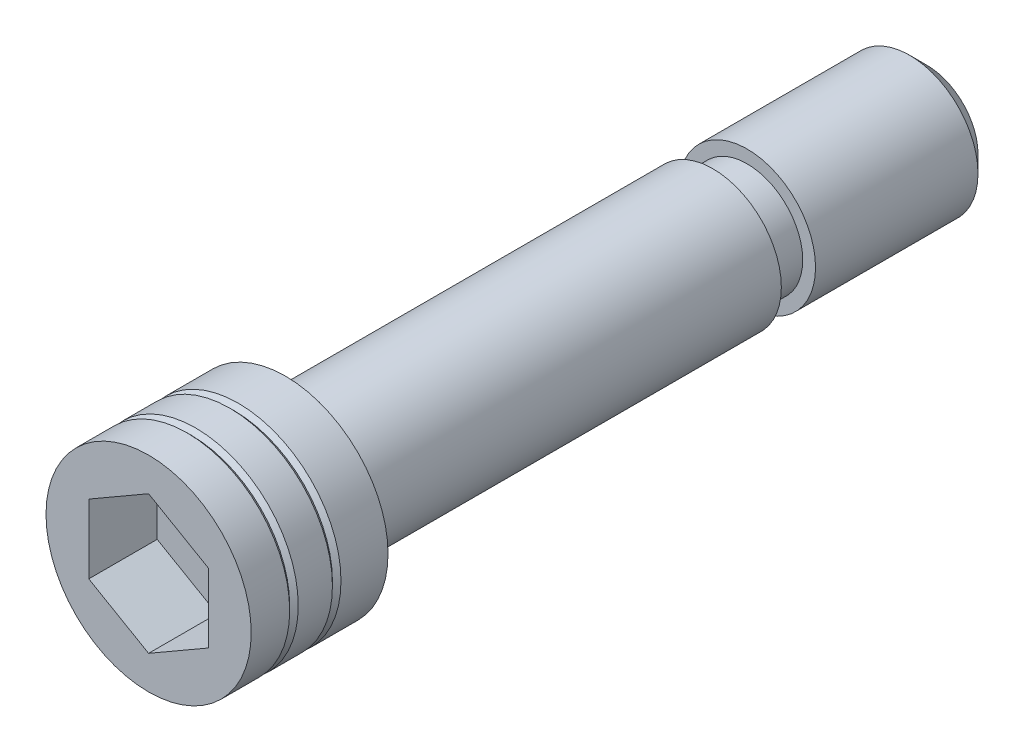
ISO-10303-21;
HEADER;
FILE_DESCRIPTION(('STEP AP214'),'2;1');
FILE_NAME('part.step','',(''),(''),'','','');
FILE_SCHEMA(('AUTOMOTIVE_DESIGN { 1 0 10303 214 1 1 1 1 }'));
ENDSEC;
DATA;
#1=APPLICATION_CONTEXT('core data for automotive mechanical design processes');
#2=APPLICATION_PROTOCOL_DEFINITION('international standard','automotive_design',2000,#1);
#3=PRODUCT_CONTEXT('',#1,'mechanical');
#4=PRODUCT('Part','Part','',(#3));
#5=PRODUCT_RELATED_PRODUCT_CATEGORY('part','',(#4));
#6=PRODUCT_DEFINITION_FORMATION('','',#4);
#7=PRODUCT_DEFINITION_CONTEXT('part definition',#1,'design');
#8=PRODUCT_DEFINITION('design','',#6,#7);
#9=PRODUCT_DEFINITION_SHAPE('','',#8);
#10=(LENGTH_UNIT() NAMED_UNIT(*) SI_UNIT(.MILLI.,.METRE.));
#11=(NAMED_UNIT(*) PLANE_ANGLE_UNIT() SI_UNIT($,.RADIAN.));
#12=(NAMED_UNIT(*) SI_UNIT($,.STERADIAN.) SOLID_ANGLE_UNIT());
#13=UNCERTAINTY_MEASURE_WITH_UNIT(LENGTH_MEASURE(1.E-05),#10,'distance_accuracy_value','');
#14=(GEOMETRIC_REPRESENTATION_CONTEXT(3) GLOBAL_UNCERTAINTY_ASSIGNED_CONTEXT((#13)) GLOBAL_UNIT_ASSIGNED_CONTEXT((#10,
#11,#12)) REPRESENTATION_CONTEXT('',''));
#15=CARTESIAN_POINT('',(0.,0.,0.));
#16=DIRECTION('',(0.,0.,1.));
#17=DIRECTION('',(1.,0.,0.));
#18=AXIS2_PLACEMENT_3D('',#15,#16,#17);
#19=CARTESIAN_POINT('',(0.,0.,5.));
#20=DIRECTION('',(0.,0.,1.));
#21=DIRECTION('',(1.,0.,0.));
#22=AXIS2_PLACEMENT_3D('',#19,#20,#21);
#23=CYLINDRICAL_SURFACE('',#22,12.);
#24=CARTESIAN_POINT('',(0.,0.,0.));
#25=DIRECTION('',(0.,0.,1.));
#26=DIRECTION('',(1.,0.,0.));
#27=AXIS2_PLACEMENT_3D('',#24,#25,#26);
#28=CIRCLE('',#27,12.);
#29=CARTESIAN_POINT('',(12.,0.,0.));
#30=VERTEX_POINT('',#29);
#31=EDGE_CURVE('E23',#30,#30,#28,.T.);
#32=ORIENTED_EDGE('',*,*,#31,.T.);
#33=EDGE_LOOP('',(#32));
#34=FACE_BOUND('',#33,.T.);
#35=CARTESIAN_POINT('',(0.,0.,5.5));
#36=DIRECTION('',(0.,0.,-1.));
#37=DIRECTION('',(-1.,0.,0.));
#38=AXIS2_PLACEMENT_3D('',#35,#36,#37);
#39=CIRCLE('',#38,12.);
#40=CARTESIAN_POINT('',(-12.,0.,5.5));
#41=VERTEX_POINT('',#40);
#42=EDGE_CURVE('E18',#41,#41,#39,.F.);
#43=ORIENTED_EDGE('',*,*,#42,.F.);
#44=EDGE_LOOP('',(#43));
#45=FACE_BOUND('',#44,.T.);
#46=ADVANCED_FACE('F14',(#34,#45),#23,.T.);
#47=CARTESIAN_POINT('',(-8.,0.,0.));
#48=DIRECTION('',(0.,0.,1.));
#49=DIRECTION('',(1.,0.,0.));
#50=AXIS2_PLACEMENT_3D('',#47,#48,#49);
#51=PLANE('',#50);
#52=ORIENTED_EDGE('',*,*,#31,.F.);
#53=EDGE_LOOP('',(#52));
#54=FACE_BOUND('',#53,.T.);
#55=CARTESIAN_POINT('',(0.,0.,0.));
#56=DIRECTION('',(0.,0.,1.));
#57=DIRECTION('',(1.,0.,0.));
#58=AXIS2_PLACEMENT_3D('',#55,#56,#57);
#59=CIRCLE('',#58,8.);
#60=CARTESIAN_POINT('',(8.,0.,0.));
#61=VERTEX_POINT('',#60);
#62=EDGE_CURVE('E142',#61,#61,#59,.T.);
#63=ORIENTED_EDGE('',*,*,#62,.T.);
#64=EDGE_LOOP('',(#63));
#65=FACE_BOUND('',#64,.T.);
#66=ADVANCED_FACE('F187',(#54,#65),#51,.F.);
#67=CARTESIAN_POINT('',(0.,0.,5.));
#68=DIRECTION('',(0.,0.,1.));
#69=DIRECTION('',(1.,0.,0.));
#70=AXIS2_PLACEMENT_3D('',#67,#68,#69);
#71=CYLINDRICAL_SURFACE('',#70,8.);
#72=ORIENTED_EDGE('',*,*,#62,.F.);
#73=EDGE_LOOP('',(#72));
#74=FACE_BOUND('',#73,.T.);
#75=CARTESIAN_POINT('',(0.,0.,-50.));
#76=DIRECTION('',(0.,0.,1.));
#77=DIRECTION('',(1.,0.,0.));
#78=AXIS2_PLACEMENT_3D('',#75,#76,#77);
#79=CIRCLE('',#78,8.);
#80=CARTESIAN_POINT('',(8.,0.,-50.));
#81=VERTEX_POINT('',#80);
#82=EDGE_CURVE('E139',#81,#81,#79,.T.);
#83=ORIENTED_EDGE('',*,*,#82,.T.);
#84=EDGE_LOOP('',(#83));
#85=FACE_BOUND('',#84,.T.);
#86=ADVANCED_FACE('F248',(#74,#85),#71,.T.);
#87=CARTESIAN_POINT('',(-6.5,0.,-50.));
#88=DIRECTION('',(0.,0.,1.));
#89=DIRECTION('',(1.,0.,0.));
#90=AXIS2_PLACEMENT_3D('',#87,#88,#89);
#91=PLANE('',#90);
#92=ORIENTED_EDGE('',*,*,#82,.F.);
#93=EDGE_LOOP('',(#92));
#94=FACE_BOUND('',#93,.T.);
#95=CARTESIAN_POINT('',(0.,0.,-50.));
#96=DIRECTION('',(0.,0.,1.));
#97=DIRECTION('',(1.,0.,0.));
#98=AXIS2_PLACEMENT_3D('',#95,#96,#97);
#99=CIRCLE('',#98,6.5);
#100=CARTESIAN_POINT('',(6.5,0.,-50.));
#101=VERTEX_POINT('',#100);
#102=EDGE_CURVE('E136',#101,#101,#99,.T.);
#103=ORIENTED_EDGE('',*,*,#102,.T.);
#104=EDGE_LOOP('',(#103));
#105=FACE_BOUND('',#104,.T.);
#106=ADVANCED_FACE('F244',(#94,#105),#91,.F.);
#107=CARTESIAN_POINT('',(0.,0.,5.));
#108=DIRECTION('',(0.,0.,1.));
#109=DIRECTION('',(1.,0.,0.));
#110=AXIS2_PLACEMENT_3D('',#107,#108,#109);
#111=CYLINDRICAL_SURFACE('',#110,6.5);
#112=ORIENTED_EDGE('',*,*,#102,.F.);
#113=EDGE_LOOP('',(#112));
#114=FACE_BOUND('',#113,.T.);
#115=CARTESIAN_POINT('',(0.,0.,-54.));
#116=DIRECTION('',(0.,0.,1.));
#117=DIRECTION('',(1.,0.,0.));
#118=AXIS2_PLACEMENT_3D('',#115,#116,#117);
#119=CIRCLE('',#118,6.5);
#120=CARTESIAN_POINT('',(6.5,0.,-54.));
#121=VERTEX_POINT('',#120);
#122=EDGE_CURVE('E133',#121,#121,#119,.T.);
#123=ORIENTED_EDGE('',*,*,#122,.T.);
#124=EDGE_LOOP('',(#123));
#125=FACE_BOUND('',#124,.T.);
#126=ADVANCED_FACE('F240',(#114,#125),#111,.T.);
#127=CARTESIAN_POINT('',(-8.,0.,-54.));
#128=DIRECTION('',(0.,0.,-1.));
#129=DIRECTION('',(-1.,0.,0.));
#130=AXIS2_PLACEMENT_3D('',#127,#128,#129);
#131=PLANE('',#130);
#132=ORIENTED_EDGE('',*,*,#122,.F.);
#133=EDGE_LOOP('',(#132));
#134=FACE_BOUND('',#133,.T.);
#135=CARTESIAN_POINT('',(0.,0.,-54.));
#136=DIRECTION('',(0.,0.,1.));
#137=DIRECTION('',(1.,0.,0.));
#138=AXIS2_PLACEMENT_3D('',#135,#136,#137);
#139=CIRCLE('',#138,8.);
#140=CARTESIAN_POINT('',(8.,0.,-54.));
#141=VERTEX_POINT('',#140);
#142=EDGE_CURVE('E130',#141,#141,#139,.T.);
#143=ORIENTED_EDGE('',*,*,#142,.T.);
#144=EDGE_LOOP('',(#143));
#145=FACE_BOUND('',#144,.T.);
#146=ADVANCED_FACE('F236',(#134,#145),#131,.F.);
#147=CARTESIAN_POINT('',(0.,0.,5.));
#148=DIRECTION('',(0.,0.,1.));
#149=DIRECTION('',(1.,0.,0.));
#150=AXIS2_PLACEMENT_3D('',#147,#148,#149);
#151=CYLINDRICAL_SURFACE('',#150,8.);
#152=ORIENTED_EDGE('',*,*,#142,.F.);
#153=EDGE_LOOP('',(#152));
#154=FACE_BOUND('',#153,.T.);
#155=CARTESIAN_POINT('',(0.,0.,-73.));
#156=DIRECTION('',(0.,0.,1.));
#157=DIRECTION('',(1.,0.,0.));
#158=AXIS2_PLACEMENT_3D('',#155,#156,#157);
#159=CIRCLE('',#158,8.);
#160=CARTESIAN_POINT('',(8.,0.,-73.));
#161=VERTEX_POINT('',#160);
#162=EDGE_CURVE('E127',#161,#161,#159,.T.);
#163=ORIENTED_EDGE('',*,*,#162,.T.);
#164=EDGE_LOOP('',(#163));
#165=FACE_BOUND('',#164,.T.);
#166=ADVANCED_FACE('F232',(#154,#165),#151,.T.);
#167=CARTESIAN_POINT('',(0.,0.,-75.));
#168=DIRECTION('',(0.,0.,1.));
#169=DIRECTION('',(1.,0.,0.));
#170=AXIS2_PLACEMENT_3D('',#167,#168,#169);
#171=CONICAL_SURFACE('',#170,6.,0.785398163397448);
#172=ORIENTED_EDGE('',*,*,#162,.F.);
#173=EDGE_LOOP('',(#172));
#174=FACE_BOUND('',#173,.T.);
#175=CARTESIAN_POINT('',(0.,0.,-75.));
#176=DIRECTION('',(0.,0.,1.));
#177=DIRECTION('',(1.,0.,0.));
#178=AXIS2_PLACEMENT_3D('',#175,#176,#177);
#179=CIRCLE('',#178,6.);
#180=CARTESIAN_POINT('',(6.,0.,-75.));
#181=VERTEX_POINT('',#180);
#182=EDGE_CURVE('E118',#181,#181,#179,.T.);
#183=ORIENTED_EDGE('',*,*,#182,.T.);
#184=EDGE_LOOP('',(#183));
#185=FACE_BOUND('',#184,.T.);
#186=ADVANCED_FACE('F228',(#174,#185),#171,.T.);
#187=CARTESIAN_POINT('',(0.,0.,-75.));
#188=DIRECTION('',(0.,0.,1.));
#189=DIRECTION('',(1.,0.,0.));
#190=AXIS2_PLACEMENT_3D('',#187,#188,#189);
#191=PLANE('',#190);
#192=ORIENTED_EDGE('',*,*,#182,.F.);
#193=EDGE_LOOP('',(#192));
#194=FACE_BOUND('',#193,.T.);
#195=ADVANCED_FACE('F224',(#194),#191,.F.);
#196=CARTESIAN_POINT('',(0.,0.,4.16946587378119));
#197=DIRECTION('',(0.,0.,-1.));
#198=DIRECTION('',(-1.,0.,0.));
#199=AXIS2_PLACEMENT_3D('',#196,#197,#198);
#200=CONICAL_SURFACE('',#199,13.3305341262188,0.785398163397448);
#201=CARTESIAN_POINT('',(0.,0.,6.));
#202=DIRECTION('',(0.,0.,-1.));
#203=DIRECTION('',(-1.,0.,0.));
#204=AXIS2_PLACEMENT_3D('',#201,#202,#203);
#205=CIRCLE('',#204,11.5);
#206=CARTESIAN_POINT('',(-11.5,0.,6.));
#207=VERTEX_POINT('',#206);
#208=EDGE_CURVE('E155',#207,#207,#205,.T.);
#209=ORIENTED_EDGE('',*,*,#208,.T.);
#210=EDGE_LOOP('',(#209));
#211=FACE_BOUND('',#210,.T.);
#212=ORIENTED_EDGE('',*,*,#42,.T.);
#213=EDGE_LOOP('',(#212));
#214=FACE_BOUND('',#213,.T.);
#215=ADVANCED_FACE('F227',(#211,#214),#200,.T.);
#216=CARTESIAN_POINT('',(0.,0.,6.));
#217=DIRECTION('',(0.,0.,1.));
#218=DIRECTION('',(1.,0.,0.));
#219=AXIS2_PLACEMENT_3D('',#216,#217,#218);
#220=CONICAL_SURFACE('',#219,11.5,0.785398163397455);
#221=ORIENTED_EDGE('',*,*,#208,.F.);
#222=EDGE_LOOP('',(#221));
#223=FACE_BOUND('',#222,.T.);
#224=CARTESIAN_POINT('',(0.,0.,6.5));
#225=DIRECTION('',(0.,0.,1.));
#226=DIRECTION('',(1.,0.,0.));
#227=AXIS2_PLACEMENT_3D('',#224,#225,#226);
#228=CIRCLE('',#227,12.);
#229=CARTESIAN_POINT('',(12.,0.,6.5));
#230=VERTEX_POINT('',#229);
#231=EDGE_CURVE('E153',#230,#230,#228,.F.);
#232=ORIENTED_EDGE('',*,*,#231,.T.);
#233=EDGE_LOOP('',(#232));
#234=FACE_BOUND('',#233,.T.);
#235=ADVANCED_FACE('F204',(#223,#234),#220,.T.);
#236=CARTESIAN_POINT('',(-7.,12.1243556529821,8.));
#237=DIRECTION('',(0.,0.,1.));
#238=DIRECTION('',(1.,0.,0.));
#239=AXIS2_PLACEMENT_3D('',#236,#237,#238);
#240=PLANE('',#239);
#241=DIRECTION('',(-0.866025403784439,0.5,0.));
#242=VECTOR('',#241,1.);
#243=CARTESIAN_POINT('',(7.,4.04145188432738,8.));
#244=LINE('',#243,#242);
#245=CARTESIAN_POINT('',(7.,4.04145188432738,8.));
#246=VERTEX_POINT('',#245);
#247=CARTESIAN_POINT('',(0.,8.08290376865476,8.));
#248=VERTEX_POINT('',#247);
#249=EDGE_CURVE('E102',#246,#248,#244,.T.);
#250=ORIENTED_EDGE('',*,*,#249,.T.);
#251=DIRECTION('',(-0.866025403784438,-0.5,0.));
#252=VECTOR('',#251,1.);
#253=CARTESIAN_POINT('',(0.,8.08290376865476,8.));
#254=LINE('',#253,#252);
#255=CARTESIAN_POINT('',(-7.,4.04145188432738,8.));
#256=VERTEX_POINT('',#255);
#257=EDGE_CURVE('E105',#248,#256,#254,.T.);
#258=ORIENTED_EDGE('',*,*,#257,.T.);
#259=DIRECTION('',(0.,-1.,0.));
#260=VECTOR('',#259,1.);
#261=CARTESIAN_POINT('',(-7.,4.04145188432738,8.));
#262=LINE('',#261,#260);
#263=CARTESIAN_POINT('',(-7.,-4.04145188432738,8.));
#264=VERTEX_POINT('',#263);
#265=EDGE_CURVE('E77',#256,#264,#262,.T.);
#266=ORIENTED_EDGE('',*,*,#265,.T.);
#267=DIRECTION('',(0.866025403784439,-0.5,0.));
#268=VECTOR('',#267,1.);
#269=CARTESIAN_POINT('',(-7.,-4.04145188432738,8.));
#270=LINE('',#269,#268);
#271=CARTESIAN_POINT('',(0.,-8.08290376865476,8.));
#272=VERTEX_POINT('',#271);
#273=EDGE_CURVE('E108',#264,#272,#270,.T.);
#274=ORIENTED_EDGE('',*,*,#273,.T.);
#275=DIRECTION('',(0.866025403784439,0.5,0.));
#276=VECTOR('',#275,1.);
#277=CARTESIAN_POINT('',(0.,-8.08290376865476,8.));
#278=LINE('',#277,#276);
#279=CARTESIAN_POINT('',(7.,-4.04145188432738,8.));
#280=VERTEX_POINT('',#279);
#281=EDGE_CURVE('E111',#272,#280,#278,.T.);
#282=ORIENTED_EDGE('',*,*,#281,.T.);
#283=DIRECTION('',(0.,1.,0.));
#284=VECTOR('',#283,1.);
#285=CARTESIAN_POINT('',(7.,-4.04145188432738,8.));
#286=LINE('',#285,#284);
#287=EDGE_CURVE('E114',#280,#246,#286,.T.);
#288=ORIENTED_EDGE('',*,*,#287,.T.);
#289=EDGE_LOOP('',(#250,#258,#266,#274,#282,#288));
#290=FACE_BOUND('',#289,.T.);
#291=ADVANCED_FACE('F201',(#290),#240,.T.);
#292=CARTESIAN_POINT('',(-7.,4.04145188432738,8.));
#293=DIRECTION('',(-1.,0.,0.));
#294=DIRECTION('',(0.,-1.,0.));
#295=AXIS2_PLACEMENT_3D('',#292,#293,#294);
#296=PLANE('',#295);
#297=DIRECTION('',(0.,-1.,0.));
#298=VECTOR('',#297,1.);
#299=CARTESIAN_POINT('',(-7.,4.04145188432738,16.));
#300=LINE('',#299,#298);
#301=CARTESIAN_POINT('',(-7.,4.04145188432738,16.));
#302=VERTEX_POINT('',#301);
#303=CARTESIAN_POINT('',(-7.,-4.04145188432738,16.));
#304=VERTEX_POINT('',#303);
#305=EDGE_CURVE('E74',#302,#304,#300,.T.);
#306=ORIENTED_EDGE('',*,*,#305,.T.);
#307=DIRECTION('',(0.,0.,1.));
#308=VECTOR('',#307,1.);
#309=CARTESIAN_POINT('',(-7.,-4.04145188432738,8.));
#310=LINE('',#309,#308);
#311=EDGE_CURVE('E81',#264,#304,#310,.T.);
#312=ORIENTED_EDGE('',*,*,#311,.F.);
#313=ORIENTED_EDGE('',*,*,#265,.F.);
#314=DIRECTION('',(0.,0.,1.));
#315=VECTOR('',#314,1.);
#316=CARTESIAN_POINT('',(-7.,4.04145188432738,8.));
#317=LINE('',#316,#315);
#318=EDGE_CURVE('E70',#256,#302,#317,.T.);
#319=ORIENTED_EDGE('',*,*,#318,.T.);
#320=EDGE_LOOP('',(#306,#312,#313,#319));
#321=FACE_BOUND('',#320,.T.);
#322=ADVANCED_FACE('F72',(#321),#296,.F.);
#323=CARTESIAN_POINT('',(-7.,-4.04145188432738,8.));
#324=DIRECTION('',(-0.5,-0.866025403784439,0.));
#325=DIRECTION('',(0.866025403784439,-0.5,0.));
#326=AXIS2_PLACEMENT_3D('',#323,#324,#325);
#327=PLANE('',#326);
#328=DIRECTION('',(0.866025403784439,-0.5,0.));
#329=VECTOR('',#328,1.);
#330=CARTESIAN_POINT('',(-7.,-4.04145188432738,16.));
#331=LINE('',#330,#329);
#332=CARTESIAN_POINT('',(0.,-8.08290376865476,16.));
#333=VERTEX_POINT('',#332);
#334=EDGE_CURVE('E92',#304,#333,#331,.T.);
#335=ORIENTED_EDGE('',*,*,#334,.T.);
#336=DIRECTION('',(0.,0.,1.));
#337=VECTOR('',#336,1.);
#338=CARTESIAN_POINT('',(0.,-8.08290376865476,8.));
#339=LINE('',#338,#337);
#340=EDGE_CURVE('E121',#272,#333,#339,.T.);
#341=ORIENTED_EDGE('',*,*,#340,.F.);
#342=ORIENTED_EDGE('',*,*,#273,.F.);
#343=ORIENTED_EDGE('',*,*,#311,.T.);
#344=EDGE_LOOP('',(#335,#341,#342,#343));
#345=FACE_BOUND('',#344,.T.);
#346=ADVANCED_FACE('F213',(#345),#327,.F.);
#347=CARTESIAN_POINT('',(0.,-8.08290376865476,8.));
#348=DIRECTION('',(0.5,-0.866025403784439,0.));
#349=DIRECTION('',(0.866025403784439,0.5,0.));
#350=AXIS2_PLACEMENT_3D('',#347,#348,#349);
#351=PLANE('',#350);
#352=DIRECTION('',(0.866025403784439,0.5,0.));
#353=VECTOR('',#352,1.);
#354=CARTESIAN_POINT('',(0.,-8.08290376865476,16.));
#355=LINE('',#354,#353);
#356=CARTESIAN_POINT('',(7.,-4.04145188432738,16.));
#357=VERTEX_POINT('',#356);
#358=EDGE_CURVE('E94',#333,#357,#355,.T.);
#359=ORIENTED_EDGE('',*,*,#358,.T.);
#360=DIRECTION('',(0.,0.,1.));
#361=VECTOR('',#360,1.);
#362=CARTESIAN_POINT('',(7.,-4.04145188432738,8.));
#363=LINE('',#362,#361);
#364=EDGE_CURVE('E119',#280,#357,#363,.T.);
#365=ORIENTED_EDGE('',*,*,#364,.F.);
#366=ORIENTED_EDGE('',*,*,#281,.F.);
#367=ORIENTED_EDGE('',*,*,#340,.T.);
#368=EDGE_LOOP('',(#359,#365,#366,#367));
#369=FACE_BOUND('',#368,.T.);
#370=ADVANCED_FACE('F210',(#369),#351,.F.);
#371=CARTESIAN_POINT('',(7.,-4.04145188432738,8.));
#372=DIRECTION('',(1.,0.,0.));
#373=DIRECTION('',(0.,1.,0.));
#374=AXIS2_PLACEMENT_3D('',#371,#372,#373);
#375=PLANE('',#374);
#376=DIRECTION('',(0.,1.,0.));
#377=VECTOR('',#376,1.);
#378=CARTESIAN_POINT('',(7.,-4.04145188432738,16.));
#379=LINE('',#378,#377);
#380=CARTESIAN_POINT('',(7.,4.04145188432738,16.));
#381=VERTEX_POINT('',#380);
#382=EDGE_CURVE('E100',#357,#381,#379,.T.);
#383=ORIENTED_EDGE('',*,*,#382,.T.);
#384=DIRECTION('',(0.,0.,1.));
#385=VECTOR('',#384,1.);
#386=CARTESIAN_POINT('',(7.,4.04145188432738,8.));
#387=LINE('',#386,#385);
#388=EDGE_CURVE('E38',#246,#381,#387,.T.);
#389=ORIENTED_EDGE('',*,*,#388,.F.);
#390=ORIENTED_EDGE('',*,*,#287,.F.);
#391=ORIENTED_EDGE('',*,*,#364,.T.);
#392=EDGE_LOOP('',(#383,#389,#390,#391));
#393=FACE_BOUND('',#392,.T.);
#394=ADVANCED_FACE('F206',(#393),#375,.F.);
#395=CARTESIAN_POINT('',(7.,4.04145188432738,8.));
#396=DIRECTION('',(0.5,0.866025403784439,0.));
#397=DIRECTION('',(-0.866025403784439,0.5,0.));
#398=AXIS2_PLACEMENT_3D('',#395,#396,#397);
#399=PLANE('',#398);
#400=DIRECTION('',(-0.866025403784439,0.5,0.));
#401=VECTOR('',#400,1.);
#402=CARTESIAN_POINT('',(7.,4.04145188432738,16.));
#403=LINE('',#402,#401);
#404=CARTESIAN_POINT('',(0.,8.08290376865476,16.));
#405=VERTEX_POINT('',#404);
#406=EDGE_CURVE('E31',#381,#405,#403,.T.);
#407=ORIENTED_EDGE('',*,*,#406,.T.);
#408=DIRECTION('',(0.,0.,1.));
#409=VECTOR('',#408,1.);
#410=CARTESIAN_POINT('',(0.,8.08290376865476,8.));
#411=LINE('',#410,#409);
#412=EDGE_CURVE('E82',#248,#405,#411,.T.);
#413=ORIENTED_EDGE('',*,*,#412,.F.);
#414=ORIENTED_EDGE('',*,*,#249,.F.);
#415=ORIENTED_EDGE('',*,*,#388,.T.);
#416=EDGE_LOOP('',(#407,#413,#414,#415));
#417=FACE_BOUND('',#416,.T.);
#418=ADVANCED_FACE('F209',(#417),#399,.F.);
#419=CARTESIAN_POINT('',(0.,8.08290376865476,8.));
#420=DIRECTION('',(-0.5,0.866025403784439,0.));
#421=DIRECTION('',(-0.866025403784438,-0.5,0.));
#422=AXIS2_PLACEMENT_3D('',#419,#420,#421);
#423=PLANE('',#422);
#424=DIRECTION('',(-0.866025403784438,-0.5,0.));
#425=VECTOR('',#424,1.);
#426=CARTESIAN_POINT('',(0.,8.08290376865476,16.));
#427=LINE('',#426,#425);
#428=EDGE_CURVE('E85',#405,#302,#427,.T.);
#429=ORIENTED_EDGE('',*,*,#428,.T.);
#430=ORIENTED_EDGE('',*,*,#318,.F.);
#431=ORIENTED_EDGE('',*,*,#257,.F.);
#432=ORIENTED_EDGE('',*,*,#412,.T.);
#433=EDGE_LOOP('',(#429,#430,#431,#432));
#434=FACE_BOUND('',#433,.T.);
#435=ADVANCED_FACE('F86',(#434),#423,.F.);
#436=CARTESIAN_POINT('',(-12.,0.,16.));
#437=DIRECTION('',(0.,0.,-1.));
#438=DIRECTION('',(-1.,0.,0.));
#439=AXIS2_PLACEMENT_3D('',#436,#437,#438);
#440=PLANE('',#439);
#441=ORIENTED_EDGE('',*,*,#428,.F.);
#442=ORIENTED_EDGE('',*,*,#406,.F.);
#443=ORIENTED_EDGE('',*,*,#382,.F.);
#444=ORIENTED_EDGE('',*,*,#358,.F.);
#445=ORIENTED_EDGE('',*,*,#334,.F.);
#446=ORIENTED_EDGE('',*,*,#305,.F.);
#447=EDGE_LOOP('',(#441,#442,#443,#444,#445,#446));
#448=FACE_BOUND('',#447,.T.);
#449=CARTESIAN_POINT('',(0.,0.,16.));
#450=DIRECTION('',(0.,0.,1.));
#451=DIRECTION('',(1.,0.,0.));
#452=AXIS2_PLACEMENT_3D('',#449,#450,#451);
#453=CIRCLE('',#452,12.);
#454=CARTESIAN_POINT('',(12.,0.,16.));
#455=VERTEX_POINT('',#454);
#456=EDGE_CURVE('E9',#455,#455,#453,.T.);
#457=ORIENTED_EDGE('',*,*,#456,.T.);
#458=EDGE_LOOP('',(#457));
#459=FACE_BOUND('',#458,.T.);
#460=ADVANCED_FACE('F16',(#448,#459),#440,.F.);
#461=ORIENTED_EDGE('',*,*,#456,.F.);
#462=EDGE_LOOP('',(#461));
#463=FACE_BOUND('',#462,.T.);
#464=CARTESIAN_POINT('',(0.,0.,11.5));
#465=DIRECTION('',(0.,0.,1.));
#466=DIRECTION('',(1.,0.,0.));
#467=AXIS2_PLACEMENT_3D('',#464,#465,#466);
#468=CIRCLE('',#467,12.);
#469=CARTESIAN_POINT('',(12.,0.,11.5));
#470=VERTEX_POINT('',#469);
#471=EDGE_CURVE('E147',#470,#470,#468,.F.);
#472=ORIENTED_EDGE('',*,*,#471,.F.);
#473=EDGE_LOOP('',(#472));
#474=FACE_BOUND('',#473,.T.);
#475=ADVANCED_FACE('F173',(#463,#474),#23,.T.);
#476=CARTESIAN_POINT('',(0.,0.,11.));
#477=DIRECTION('',(0.,0.,1.));
#478=DIRECTION('',(1.,0.,0.));
#479=AXIS2_PLACEMENT_3D('',#476,#477,#478);
#480=CONICAL_SURFACE('',#479,11.5,0.785398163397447);
#481=CARTESIAN_POINT('',(0.,0.,11.));
#482=DIRECTION('',(0.,0.,-1.));
#483=DIRECTION('',(-1.,0.,0.));
#484=AXIS2_PLACEMENT_3D('',#481,#482,#483);
#485=CIRCLE('',#484,11.5);
#486=CARTESIAN_POINT('',(-11.5,0.,11.));
#487=VERTEX_POINT('',#486);
#488=EDGE_CURVE('E151',#487,#487,#485,.T.);
#489=ORIENTED_EDGE('',*,*,#488,.F.);
#490=EDGE_LOOP('',(#489));
#491=FACE_BOUND('',#490,.T.);
#492=ORIENTED_EDGE('',*,*,#471,.T.);
#493=EDGE_LOOP('',(#492));
#494=FACE_BOUND('',#493,.T.);
#495=ADVANCED_FACE('F170',(#491,#494),#480,.T.);
#496=CARTESIAN_POINT('',(0.,0.,9.16946587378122));
#497=DIRECTION('',(0.,0.,-1.));
#498=DIRECTION('',(-1.,0.,0.));
#499=AXIS2_PLACEMENT_3D('',#496,#497,#498);
#500=CONICAL_SURFACE('',#499,13.3305341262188,0.785398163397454);
#501=ORIENTED_EDGE('',*,*,#488,.T.);
#502=EDGE_LOOP('',(#501));
#503=FACE_BOUND('',#502,.T.);
#504=CARTESIAN_POINT('',(0.,0.,10.5));
#505=DIRECTION('',(0.,0.,-1.));
#506=DIRECTION('',(-1.,0.,0.));
#507=AXIS2_PLACEMENT_3D('',#504,#505,#506);
#508=CIRCLE('',#507,12.);
#509=CARTESIAN_POINT('',(-12.,0.,10.5));
#510=VERTEX_POINT('',#509);
#511=EDGE_CURVE('E150',#510,#510,#508,.F.);
#512=ORIENTED_EDGE('',*,*,#511,.T.);
#513=EDGE_LOOP('',(#512));
#514=FACE_BOUND('',#513,.T.);
#515=ADVANCED_FACE('F167',(#503,#514),#500,.T.);
#516=ORIENTED_EDGE('',*,*,#511,.F.);
#517=EDGE_LOOP('',(#516));
#518=FACE_BOUND('',#517,.T.);
#519=ORIENTED_EDGE('',*,*,#231,.F.);
#520=EDGE_LOOP('',(#519));
#521=FACE_BOUND('',#520,.T.);
#522=ADVANCED_FACE('F179',(#518,#521),#23,.T.);
#523=CLOSED_SHELL('',(#46,#66,#86,#106,#126,#146,#166,#186,#195,#215,#235,#291,#322,#346,#370,
#394,#418,#435,#460,#475,#495,#515,#522));
#524=MANIFOLD_SOLID_BREP('B1',#523);
#525=ADVANCED_BREP_SHAPE_REPRESENTATION('',(#18,#524),#14);
#526=SHAPE_DEFINITION_REPRESENTATION(#9,#525);
ENDSEC;
END-ISO-10303-21;
